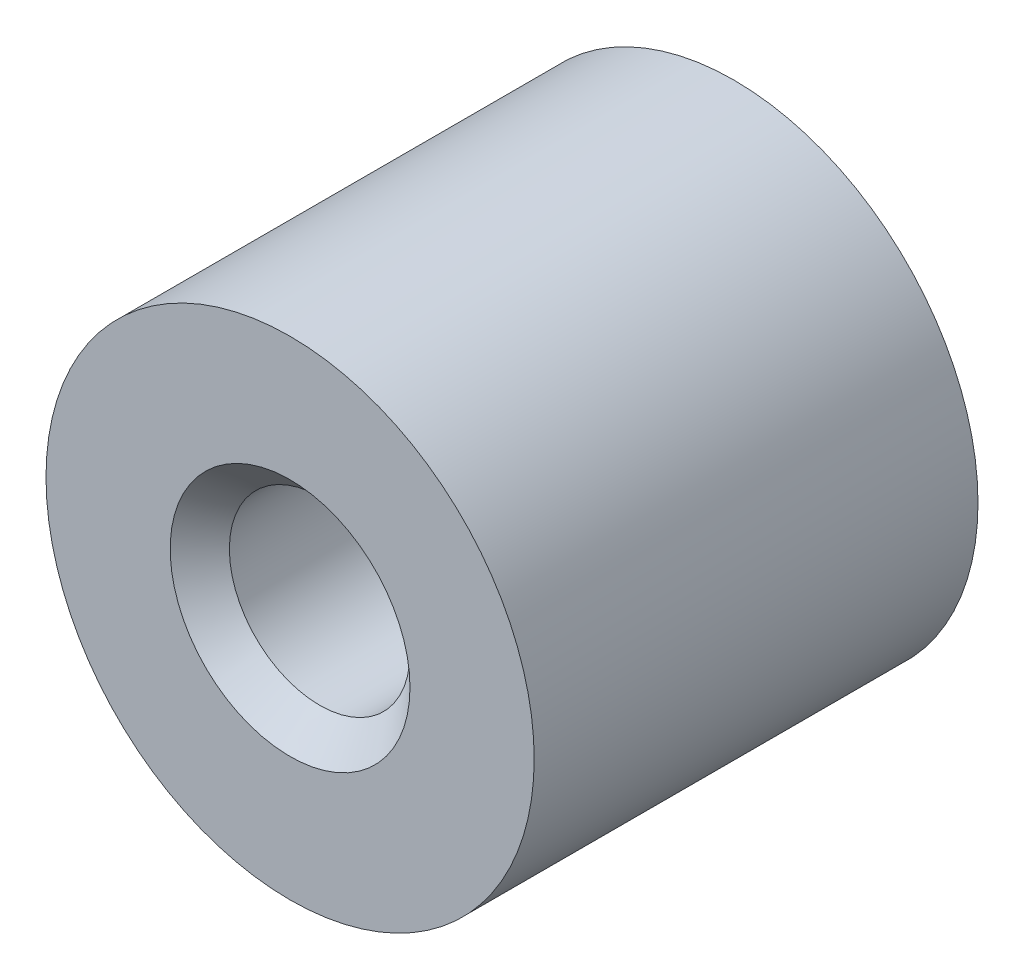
ISO-10303-21;
HEADER;
FILE_DESCRIPTION(('STEP AP214'),'2;1');
FILE_NAME('part.step','',(''),(''),'','','');
FILE_SCHEMA(('AUTOMOTIVE_DESIGN { 1 0 10303 214 1 1 1 1 }'));
ENDSEC;
DATA;
#1=APPLICATION_CONTEXT('core data for automotive mechanical design processes');
#2=APPLICATION_PROTOCOL_DEFINITION('international standard','automotive_design',2000,#1);
#3=PRODUCT_CONTEXT('',#1,'mechanical');
#4=PRODUCT('Part','Part','',(#3));
#5=PRODUCT_RELATED_PRODUCT_CATEGORY('part','',(#4));
#6=PRODUCT_DEFINITION_FORMATION('','',#4);
#7=PRODUCT_DEFINITION_CONTEXT('part definition',#1,'design');
#8=PRODUCT_DEFINITION('design','',#6,#7);
#9=PRODUCT_DEFINITION_SHAPE('','',#8);
#10=(LENGTH_UNIT() NAMED_UNIT(*) SI_UNIT(.MILLI.,.METRE.));
#11=(NAMED_UNIT(*) PLANE_ANGLE_UNIT() SI_UNIT($,.RADIAN.));
#12=(NAMED_UNIT(*) SI_UNIT($,.STERADIAN.) SOLID_ANGLE_UNIT());
#13=UNCERTAINTY_MEASURE_WITH_UNIT(LENGTH_MEASURE(1.E-05),#10,'distance_accuracy_value','');
#14=(GEOMETRIC_REPRESENTATION_CONTEXT(3) GLOBAL_UNCERTAINTY_ASSIGNED_CONTEXT((#13)) GLOBAL_UNIT_ASSIGNED_CONTEXT((#10,
#11,#12)) REPRESENTATION_CONTEXT('',''));
#15=CARTESIAN_POINT('',(0.,0.,0.));
#16=DIRECTION('',(0.,0.,1.));
#17=DIRECTION('',(1.,0.,0.));
#18=AXIS2_PLACEMENT_3D('',#15,#16,#17);
#19=CARTESIAN_POINT('',(0.,0.,-0.5));
#20=DIRECTION('',(0.,0.,1.));
#21=DIRECTION('',(1.,0.,0.));
#22=AXIS2_PLACEMENT_3D('',#19,#20,#21);
#23=PLANE('',#22);
#24=CARTESIAN_POINT('',(0.,0.,-0.5));
#25=DIRECTION('',(0.,0.,1.));
#26=DIRECTION('',(1.,0.,0.));
#27=AXIS2_PLACEMENT_3D('',#24,#25,#26);
#28=CIRCLE('',#27,0.4);
#29=CARTESIAN_POINT('',(0.4,0.,-0.5));
#30=VERTEX_POINT('',#29);
#31=EDGE_CURVE('E29',#30,#30,#28,.T.);
#32=ORIENTED_EDGE('',*,*,#31,.F.);
#33=EDGE_LOOP('',(#32));
#34=FACE_BOUND('',#33,.T.);
#35=ADVANCED_FACE('F17',(#34),#23,.F.);
#36=CARTESIAN_POINT('',(0.,0.,-0.5));
#37=DIRECTION('',(0.,0.,1.));
#38=DIRECTION('',(1.,0.,0.));
#39=AXIS2_PLACEMENT_3D('',#36,#37,#38);
#40=CYLINDRICAL_SURFACE('',#39,0.4);
#41=ORIENTED_EDGE('',*,*,#31,.T.);
#42=CARTESIAN_POINT('',(0.4,0.,-0.5));
#43=CARTESIAN_POINT('',(0.4,0.,0.));
#44=(BOUNDED_CURVE() B_SPLINE_CURVE(1,(#42,#43),.UNSPECIFIED.,.F.,
.F.) B_SPLINE_CURVE_WITH_KNOTS((2,2),(0.,0.5),
.UNSPECIFIED.) CURVE() GEOMETRIC_REPRESENTATION_ITEM() RATIONAL_B_SPLINE_CURVE((1.,1.)) REPRESENTATION_ITEM(''));
#45=CARTESIAN_POINT('',(0.4,0.,0.));
#46=VERTEX_POINT('',#45);
#47=EDGE_CURVE('E11',#30,#46,#44,.T.);
#48=ORIENTED_EDGE('',*,*,#47,.T.);
#49=CARTESIAN_POINT('',(0.,0.,0.));
#50=DIRECTION('',(0.,0.,1.));
#51=DIRECTION('',(1.,0.,0.));
#52=AXIS2_PLACEMENT_3D('',#49,#50,#51);
#53=CIRCLE('',#52,0.4);
#54=EDGE_CURVE('E90',#46,#46,#53,.T.);
#55=ORIENTED_EDGE('',*,*,#54,.F.);
#56=ORIENTED_EDGE('',*,*,#47,.F.);
#57=EDGE_LOOP('',(#41,#48,#55,#56));
#58=FACE_BOUND('',#57,.T.);
#59=ADVANCED_FACE('F19',(#58),#40,.T.);
#60=CARTESIAN_POINT('',(0.,0.,1.066825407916));
#61=DIRECTION('',(0.,0.,1.));
#62=DIRECTION('',(0.,1.,0.));
#63=AXIS2_PLACEMENT_3D('',#60,#61,#62);
#64=CONICAL_SURFACE('',#63,0.6105,1.029744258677);
#65=CARTESIAN_POINT('',(0.,0.,0.699999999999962));
#66=VERTEX_POINT('',#65);
#67=VERTEX_LOOP('',#66);
#68=FACE_BOUND('',#67,.T.);
#69=CARTESIAN_POINT('',(0.,0.,1.066825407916));
#70=DIRECTION('',(0.,0.,-1.));
#71=DIRECTION('',(0.,1.,0.));
#72=AXIS2_PLACEMENT_3D('',#69,#70,#71);
#73=CIRCLE('',#72,0.6105);
#74=CARTESIAN_POINT('',(0.,0.6105,1.066825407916));
#75=VERTEX_POINT('',#74);
#76=CARTESIAN_POINT('',(0.,-0.6105,1.066825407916));
#77=VERTEX_POINT('',#76);
#78=EDGE_CURVE('E146',#75,#77,#73,.T.);
#79=ORIENTED_EDGE('',*,*,#78,.F.);
#80=CARTESIAN_POINT('',(0.,0.,1.066825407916));
#81=DIRECTION('',(0.,0.,-1.));
#82=DIRECTION('',(0.,1.,0.));
#83=AXIS2_PLACEMENT_3D('',#80,#81,#82);
#84=CIRCLE('',#83,0.6105);
#85=EDGE_CURVE('E96',#77,#75,#84,.T.);
#86=ORIENTED_EDGE('',*,*,#85,.F.);
#87=EDGE_LOOP('',(#79,#86));
#88=FACE_BOUND('',#87,.T.);
#89=ADVANCED_FACE('F182',(#68,#88),#64,.F.);
#90=CARTESIAN_POINT('',(0.,0.,3.));
#91=DIRECTION('',(0.,0.,1.));
#92=DIRECTION('',(1.,0.,0.));
#93=AXIS2_PLACEMENT_3D('',#90,#91,#92);
#94=CONICAL_SURFACE('',#93,0.8105,0.785398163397);
#95=CARTESIAN_POINT('',(0.,0.,2.8));
#96=DIRECTION('',(0.,0.,1.));
#97=DIRECTION('',(1.,0.,0.));
#98=AXIS2_PLACEMENT_3D('',#95,#96,#97);
#99=CIRCLE('',#98,0.6105);
#100=CARTESIAN_POINT('',(0.6105,0.,2.8));
#101=VERTEX_POINT('',#100);
#102=CARTESIAN_POINT('',(0.,-0.6105,2.8));
#103=VERTEX_POINT('',#102);
#104=EDGE_CURVE('E130',#101,#103,#99,.T.);
#105=ORIENTED_EDGE('',*,*,#104,.F.);
#106=CARTESIAN_POINT('',(0.6105,0.,2.8));
#107=CARTESIAN_POINT('',(0.8105,0.,3.));
#108=(BOUNDED_CURVE() B_SPLINE_CURVE(1,(#106,#107),.UNSPECIFIED.,.F.,
.F.) B_SPLINE_CURVE_WITH_KNOTS((2,2),(-0.282842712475,0.),
.UNSPECIFIED.) CURVE() GEOMETRIC_REPRESENTATION_ITEM() RATIONAL_B_SPLINE_CURVE((1.,1.)) REPRESENTATION_ITEM(''));
#109=CARTESIAN_POINT('',(0.8105,0.,3.));
#110=VERTEX_POINT('',#109);
#111=EDGE_CURVE('E21',#101,#110,#108,.T.);
#112=ORIENTED_EDGE('',*,*,#111,.T.);
#113=CARTESIAN_POINT('',(0.,0.,3.));
#114=DIRECTION('',(0.,0.,-1.));
#115=DIRECTION('',(1.,0.,0.));
#116=AXIS2_PLACEMENT_3D('',#113,#114,#115);
#117=CIRCLE('',#116,0.8105);
#118=EDGE_CURVE('E118',#110,#110,#117,.T.);
#119=ORIENTED_EDGE('',*,*,#118,.F.);
#120=ORIENTED_EDGE('',*,*,#111,.F.);
#121=CARTESIAN_POINT('',(0.,0.,2.8));
#122=DIRECTION('',(0.,0.,1.));
#123=DIRECTION('',(1.,0.,0.));
#124=AXIS2_PLACEMENT_3D('',#121,#122,#123);
#125=CIRCLE('',#124,0.6105);
#126=EDGE_CURVE('E117',#103,#101,#125,.T.);
#127=ORIENTED_EDGE('',*,*,#126,.F.);
#128=EDGE_LOOP('',(#105,#112,#119,#120,#127));
#129=FACE_BOUND('',#128,.T.);
#130=ADVANCED_FACE('F171',(#129),#94,.F.);
#131=CARTESIAN_POINT('',(0.,0.,3.));
#132=DIRECTION('',(0.,0.,-1.));
#133=DIRECTION('',(0.,-1.,0.));
#134=AXIS2_PLACEMENT_3D('',#131,#132,#133);
#135=CYLINDRICAL_SURFACE('',#134,0.6105);
#136=CARTESIAN_POINT('',(0.,-0.6105,2.8));
#137=CARTESIAN_POINT('',(0.,-0.6105,1.2));
#138=(BOUNDED_CURVE() B_SPLINE_CURVE(1,(#136,#137),.UNSPECIFIED.,.F.,
.F.) B_SPLINE_CURVE_WITH_KNOTS((2,2),(0.2,1.8),
.UNSPECIFIED.) CURVE() GEOMETRIC_REPRESENTATION_ITEM() RATIONAL_B_SPLINE_CURVE((1.,1.)) REPRESENTATION_ITEM(''));
#139=CARTESIAN_POINT('',(0.,-0.6105,1.2));
#140=VERTEX_POINT('',#139);
#141=EDGE_CURVE('E112',#103,#140,#138,.T.);
#142=ORIENTED_EDGE('',*,*,#141,.F.);
#143=ORIENTED_EDGE('',*,*,#126,.T.);
#144=ORIENTED_EDGE('',*,*,#104,.T.);
#145=ORIENTED_EDGE('',*,*,#141,.T.);
#146=CARTESIAN_POINT('',(0.,0.,1.2));
#147=DIRECTION('',(0.,0.,1.));
#148=DIRECTION('',(0.,-1.,0.));
#149=AXIS2_PLACEMENT_3D('',#146,#147,#148);
#150=CIRCLE('',#149,0.6105);
#151=EDGE_CURVE('E106',#140,#140,#150,.T.);
#152=ORIENTED_EDGE('',*,*,#151,.F.);
#153=EDGE_LOOP('',(#142,#143,#144,#145,#152));
#154=FACE_BOUND('',#153,.T.);
#155=ADVANCED_FACE('F168',(#154),#135,.F.);
#156=CARTESIAN_POINT('',(-1.65,0.,3.));
#157=DIRECTION('',(0.,0.,1.));
#158=DIRECTION('',(1.,0.,0.));
#159=AXIS2_PLACEMENT_3D('',#156,#157,#158);
#160=PLANE('',#159);
#161=CARTESIAN_POINT('',(0.,0.,3.));
#162=DIRECTION('',(0.,0.,-1.));
#163=DIRECTION('',(-1.,0.,0.));
#164=AXIS2_PLACEMENT_3D('',#161,#162,#163);
#165=CIRCLE('',#164,1.65);
#166=CARTESIAN_POINT('',(-1.65,0.,3.));
#167=VERTEX_POINT('',#166);
#168=EDGE_CURVE('E104',#167,#167,#165,.T.);
#169=ORIENTED_EDGE('',*,*,#168,.F.);
#170=EDGE_LOOP('',(#169));
#171=FACE_BOUND('',#170,.T.);
#172=ORIENTED_EDGE('',*,*,#118,.T.);
#173=EDGE_LOOP('',(#172));
#174=FACE_BOUND('',#173,.T.);
#175=ADVANCED_FACE('F170',(#171,#174),#160,.T.);
#176=CARTESIAN_POINT('',(0.,0.,4.));
#177=DIRECTION('',(0.,0.,-1.));
#178=DIRECTION('',(-1.,0.,0.));
#179=AXIS2_PLACEMENT_3D('',#176,#177,#178);
#180=CYLINDRICAL_SURFACE('',#179,1.65);
#181=ORIENTED_EDGE('',*,*,#168,.T.);
#182=CARTESIAN_POINT('',(-1.65,0.,3.));
#183=CARTESIAN_POINT('',(-1.65,0.,0.));
#184=(BOUNDED_CURVE() B_SPLINE_CURVE(1,(#182,#183),.UNSPECIFIED.,.F.,
.F.) B_SPLINE_CURVE_WITH_KNOTS((2,2),(1.,4.),
.UNSPECIFIED.) CURVE() GEOMETRIC_REPRESENTATION_ITEM() RATIONAL_B_SPLINE_CURVE((1.,1.)) REPRESENTATION_ITEM(''));
#185=CARTESIAN_POINT('',(-1.65,0.,0.));
#186=VERTEX_POINT('',#185);
#187=EDGE_CURVE('E74',#167,#186,#184,.T.);
#188=ORIENTED_EDGE('',*,*,#187,.T.);
#189=CARTESIAN_POINT('',(0.,0.,0.));
#190=DIRECTION('',(0.,0.,-1.));
#191=DIRECTION('',(-1.,0.,0.));
#192=AXIS2_PLACEMENT_3D('',#189,#190,#191);
#193=CIRCLE('',#192,1.65);
#194=EDGE_CURVE('E95',#186,#186,#193,.T.);
#195=ORIENTED_EDGE('',*,*,#194,.F.);
#196=ORIENTED_EDGE('',*,*,#187,.F.);
#197=EDGE_LOOP('',(#181,#188,#195,#196));
#198=FACE_BOUND('',#197,.T.);
#199=ADVANCED_FACE('F179',(#198),#180,.T.);
#200=CARTESIAN_POINT('',(0.,0.,0.));
#201=DIRECTION('',(0.,0.,-1.));
#202=DIRECTION('',(0.,-1.,0.));
#203=AXIS2_PLACEMENT_3D('',#200,#201,#202);
#204=PLANE('',#203);
#205=ORIENTED_EDGE('',*,*,#194,.T.);
#206=EDGE_LOOP('',(#205));
#207=FACE_BOUND('',#206,.T.);
#208=ORIENTED_EDGE('',*,*,#54,.T.);
#209=EDGE_LOOP('',(#208));
#210=FACE_BOUND('',#209,.T.);
#211=ADVANCED_FACE('F93',(#207,#210),#204,.T.);
#212=CARTESIAN_POINT('',(0.,0.,3.));
#213=DIRECTION('',(0.,0.,-1.));
#214=DIRECTION('',(0.,-1.,0.));
#215=AXIS2_PLACEMENT_3D('',#212,#213,#214);
#216=CYLINDRICAL_SURFACE('',#215,0.6105);
#217=ORIENTED_EDGE('',*,*,#78,.T.);
#218=CARTESIAN_POINT('',(0.,-0.6105,1.2));
#219=CARTESIAN_POINT('',(0.,-0.6105,1.066825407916));
#220=(BOUNDED_CURVE() B_SPLINE_CURVE(1,(#218,#219),.UNSPECIFIED.,.F.,
.F.) B_SPLINE_CURVE_WITH_KNOTS((2,2),(1.8,1.933174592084),
.UNSPECIFIED.) CURVE() GEOMETRIC_REPRESENTATION_ITEM() RATIONAL_B_SPLINE_CURVE((1.,1.)) REPRESENTATION_ITEM(''));
#221=EDGE_CURVE('E150',#140,#77,#220,.T.);
#222=ORIENTED_EDGE('',*,*,#221,.F.);
#223=ORIENTED_EDGE('',*,*,#151,.T.);
#224=ORIENTED_EDGE('',*,*,#221,.T.);
#225=ORIENTED_EDGE('',*,*,#85,.T.);
#226=EDGE_LOOP('',(#217,#222,#223,#224,#225));
#227=FACE_BOUND('',#226,.T.);
#228=ADVANCED_FACE('F167',(#227),#216,.F.);
#229=CLOSED_SHELL('',(#35,#59,#89,#130,#155,#175,#199,#211,#228));
#230=MANIFOLD_SOLID_BREP('B1',#229);
#231=ADVANCED_BREP_SHAPE_REPRESENTATION('',(#18,#230),#14);
#232=SHAPE_DEFINITION_REPRESENTATION(#9,#231);
ENDSEC;
END-ISO-10303-21;
